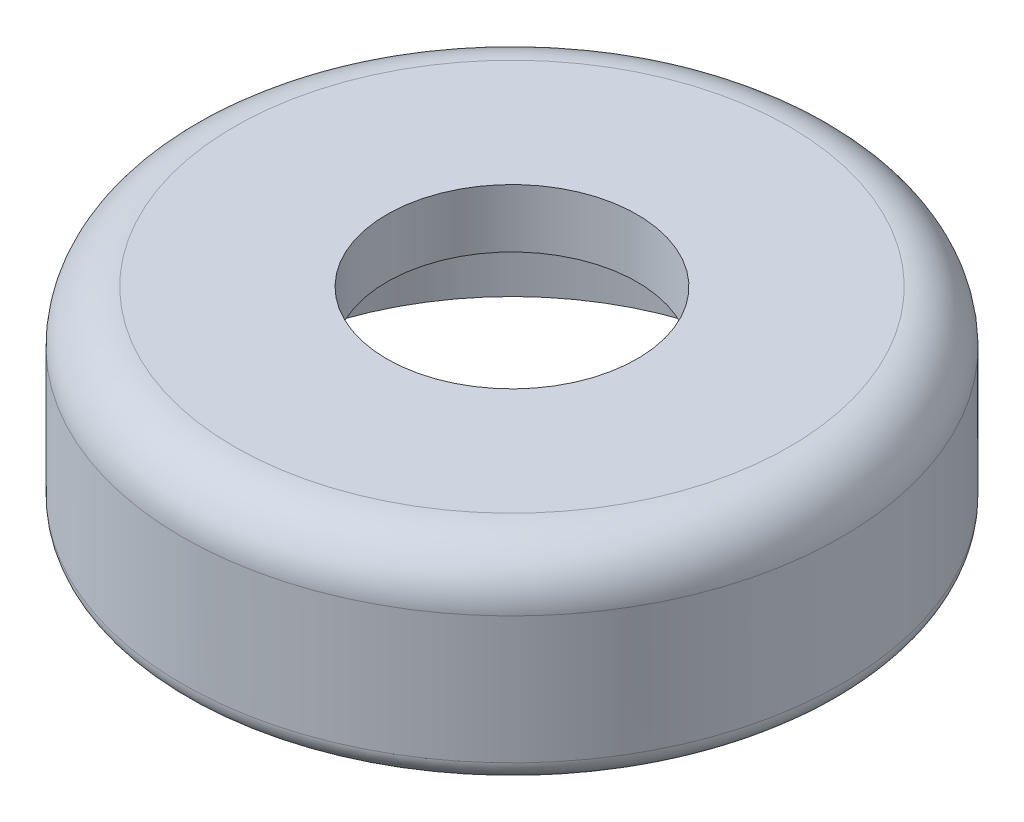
ISO-10303-21;
HEADER;
FILE_DESCRIPTION(('STEP AP214'),'2;1');
FILE_NAME('part.step','',(''),(''),'','','');
FILE_SCHEMA(('AUTOMOTIVE_DESIGN { 1 0 10303 214 1 1 1 1 }'));
ENDSEC;
DATA;
#1=APPLICATION_CONTEXT('core data for automotive mechanical design processes');
#2=APPLICATION_PROTOCOL_DEFINITION('international standard','automotive_design',2000,#1);
#3=PRODUCT_CONTEXT('',#1,'mechanical');
#4=PRODUCT('Part','Part','',(#3));
#5=PRODUCT_RELATED_PRODUCT_CATEGORY('part','',(#4));
#6=PRODUCT_DEFINITION_FORMATION('','',#4);
#7=PRODUCT_DEFINITION_CONTEXT('part definition',#1,'design');
#8=PRODUCT_DEFINITION('design','',#6,#7);
#9=PRODUCT_DEFINITION_SHAPE('','',#8);
#10=(LENGTH_UNIT() NAMED_UNIT(*) SI_UNIT(.MILLI.,.METRE.));
#11=(NAMED_UNIT(*) PLANE_ANGLE_UNIT() SI_UNIT($,.RADIAN.));
#12=(NAMED_UNIT(*) SI_UNIT($,.STERADIAN.) SOLID_ANGLE_UNIT());
#13=UNCERTAINTY_MEASURE_WITH_UNIT(LENGTH_MEASURE(1.E-05),#10,'distance_accuracy_value','');
#14=(GEOMETRIC_REPRESENTATION_CONTEXT(3) GLOBAL_UNCERTAINTY_ASSIGNED_CONTEXT((#13)) GLOBAL_UNIT_ASSIGNED_CONTEXT((#10,
#11,#12)) REPRESENTATION_CONTEXT('',''));
#15=CARTESIAN_POINT('',(0.,0.,0.));
#16=DIRECTION('',(0.,0.,1.));
#17=DIRECTION('',(1.,0.,0.));
#18=AXIS2_PLACEMENT_3D('',#15,#16,#17);
#19=CARTESIAN_POINT('',(0.,0.,0.));
#20=DIRECTION('',(0.,-1.,0.));
#21=DIRECTION('',(0.,0.,-1.));
#22=AXIS2_PLACEMENT_3D('',#19,#20,#21);
#23=CYLINDRICAL_SURFACE('',#22,8.255);
#24=CARTESIAN_POINT('',(0.,0.,0.));
#25=DIRECTION('',(0.,-1.,0.));
#26=DIRECTION('',(0.,0.,-1.));
#27=AXIS2_PLACEMENT_3D('',#24,#25,#26);
#28=CIRCLE('',#27,8.255);
#29=CARTESIAN_POINT('',(0.,0.,-8.255));
#30=VERTEX_POINT('',#29);
#31=EDGE_CURVE('E52',#30,#30,#28,.T.);
#32=ORIENTED_EDGE('',*,*,#31,.T.);
#33=EDGE_LOOP('',(#32));
#34=FACE_BOUND('',#33,.T.);
#35=CARTESIAN_POINT('',(0.,4.318,0.));
#36=DIRECTION('',(0.,-1.,0.));
#37=DIRECTION('',(0.,0.,-1.));
#38=AXIS2_PLACEMENT_3D('',#35,#36,#37);
#39=CIRCLE('',#38,8.255);
#40=CARTESIAN_POINT('',(0.,4.318,-8.255));
#41=VERTEX_POINT('',#40);
#42=EDGE_CURVE('E49',#41,#41,#39,.T.);
#43=ORIENTED_EDGE('',*,*,#42,.F.);
#44=EDGE_LOOP('',(#43));
#45=FACE_BOUND('',#44,.T.);
#46=ADVANCED_FACE('F29',(#34,#45),#23,.F.);
#47=CARTESIAN_POINT('',(0.,4.318,0.));
#48=DIRECTION('',(0.,-1.,0.));
#49=DIRECTION('',(0.,0.,-1.));
#50=AXIS2_PLACEMENT_3D('',#47,#48,#49);
#51=PLANE('',#50);
#52=CARTESIAN_POINT('',(0.,4.318,0.));
#53=DIRECTION('',(0.,-1.,0.));
#54=DIRECTION('',(0.,0.,-1.));
#55=AXIS2_PLACEMENT_3D('',#52,#53,#54);
#56=CIRCLE('',#55,3.81);
#57=CARTESIAN_POINT('',(0.,4.318,3.81));
#58=VERTEX_POINT('',#57);
#59=EDGE_CURVE('E55',#58,#58,#56,.T.);
#60=ORIENTED_EDGE('',*,*,#59,.F.);
#61=EDGE_LOOP('',(#60));
#62=FACE_BOUND('',#61,.T.);
#63=ORIENTED_EDGE('',*,*,#42,.T.);
#64=EDGE_LOOP('',(#63));
#65=FACE_BOUND('',#64,.T.);
#66=ADVANCED_FACE('F68',(#62,#65),#51,.T.);
#67=CARTESIAN_POINT('',(-10.033,6.096,0.));
#68=DIRECTION('',(0.,1.,0.));
#69=DIRECTION('',(0.,0.,1.));
#70=AXIS2_PLACEMENT_3D('',#67,#68,#69);
#71=PLANE('',#70);
#72=CARTESIAN_POINT('',(0.,6.096,0.));
#73=DIRECTION('',(0.,1.,0.));
#74=DIRECTION('',(0.,0.,1.));
#75=AXIS2_PLACEMENT_3D('',#72,#73,#74);
#76=CIRCLE('',#75,3.81);
#77=CARTESIAN_POINT('',(0.,6.096,3.81));
#78=VERTEX_POINT('',#77);
#79=EDGE_CURVE('E58',#78,#78,#76,.T.);
#80=ORIENTED_EDGE('',*,*,#79,.F.);
#81=EDGE_LOOP('',(#80));
#82=FACE_BOUND('',#81,.T.);
#83=CARTESIAN_POINT('',(0.,6.096,0.));
#84=DIRECTION('',(0.,1.,0.));
#85=DIRECTION('',(0.,0.,1.));
#86=AXIS2_PLACEMENT_3D('',#83,#84,#85);
#87=CIRCLE('',#86,8.4455);
#88=CARTESIAN_POINT('',(0.,6.096,8.4455));
#89=VERTEX_POINT('',#88);
#90=EDGE_CURVE('E40',#89,#89,#87,.T.);
#91=ORIENTED_EDGE('',*,*,#90,.T.);
#92=EDGE_LOOP('',(#91));
#93=FACE_BOUND('',#92,.T.);
#94=ADVANCED_FACE('F64',(#82,#93),#71,.T.);
#95=CARTESIAN_POINT('',(0.,0.,0.));
#96=DIRECTION('',(0.,-1.,0.));
#97=DIRECTION('',(0.,0.,-1.));
#98=AXIS2_PLACEMENT_3D('',#95,#96,#97);
#99=CYLINDRICAL_SURFACE('',#98,10.033);
#100=CARTESIAN_POINT('',(0.,0.635,0.));
#101=DIRECTION('',(0.,-1.,0.));
#102=DIRECTION('',(0.,0.,-1.));
#103=AXIS2_PLACEMENT_3D('',#100,#101,#102);
#104=CIRCLE('',#103,10.033);
#105=CARTESIAN_POINT('',(0.,0.635,-10.033));
#106=VERTEX_POINT('',#105);
#107=EDGE_CURVE('E10',#106,#106,#104,.F.);
#108=ORIENTED_EDGE('',*,*,#107,.T.);
#109=EDGE_LOOP('',(#108));
#110=FACE_BOUND('',#109,.T.);
#111=CARTESIAN_POINT('',(0.,4.5085,0.));
#112=DIRECTION('',(0.,1.,0.));
#113=DIRECTION('',(0.,0.,1.));
#114=AXIS2_PLACEMENT_3D('',#111,#112,#113);
#115=CIRCLE('',#114,10.033);
#116=CARTESIAN_POINT('',(0.,4.5085,10.033));
#117=VERTEX_POINT('',#116);
#118=EDGE_CURVE('E44',#117,#117,#115,.F.);
#119=ORIENTED_EDGE('',*,*,#118,.T.);
#120=EDGE_LOOP('',(#119));
#121=FACE_BOUND('',#120,.T.);
#122=ADVANCED_FACE('F67',(#110,#121),#99,.T.);
#123=CARTESIAN_POINT('',(-8.255,0.,0.));
#124=DIRECTION('',(0.,-1.,0.));
#125=DIRECTION('',(0.,0.,-1.));
#126=AXIS2_PLACEMENT_3D('',#123,#124,#125);
#127=PLANE('',#126);
#128=CARTESIAN_POINT('',(0.,0.,0.));
#129=DIRECTION('',(0.,-1.,0.));
#130=DIRECTION('',(0.,0.,-1.));
#131=AXIS2_PLACEMENT_3D('',#128,#129,#130);
#132=CIRCLE('',#131,9.398);
#133=CARTESIAN_POINT('',(0.,0.,-9.398));
#134=VERTEX_POINT('',#133);
#135=EDGE_CURVE('E36',#134,#134,#132,.T.);
#136=ORIENTED_EDGE('',*,*,#135,.T.);
#137=EDGE_LOOP('',(#136));
#138=FACE_BOUND('',#137,.T.);
#139=ORIENTED_EDGE('',*,*,#31,.F.);
#140=EDGE_LOOP('',(#139));
#141=FACE_BOUND('',#140,.T.);
#142=ADVANCED_FACE('F75',(#138,#141),#127,.T.);
#143=CARTESIAN_POINT('',(0.,4.5085,0.));
#144=DIRECTION('',(0.,1.,0.));
#145=DIRECTION('',(0.,0.,1.));
#146=AXIS2_PLACEMENT_3D('',#143,#144,#145);
#147=TOROIDAL_SURFACE('',#146,8.4455,1.5875);
#148=ORIENTED_EDGE('',*,*,#90,.F.);
#149=EDGE_LOOP('',(#148));
#150=FACE_BOUND('',#149,.T.);
#151=ORIENTED_EDGE('',*,*,#118,.F.);
#152=EDGE_LOOP('',(#151));
#153=FACE_BOUND('',#152,.T.);
#154=ADVANCED_FACE('F72',(#150,#153),#147,.T.);
#155=CARTESIAN_POINT('',(0.,0.,0.));
#156=DIRECTION('',(0.,1.,0.));
#157=DIRECTION('',(0.,0.,1.));
#158=AXIS2_PLACEMENT_3D('',#155,#156,#157);
#159=CYLINDRICAL_SURFACE('',#158,3.81);
#160=CARTESIAN_POINT('',(0.,4.318,3.81));
#161=CARTESIAN_POINT('',(0.,4.33652083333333,3.81));
#162=CARTESIAN_POINT('',(0.,4.35504166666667,3.81));
#163=CARTESIAN_POINT('',(0.,4.39208333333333,3.81));
#164=CARTESIAN_POINT('',(0.,4.41060416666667,3.81));
#165=CARTESIAN_POINT('',(0.,4.44764583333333,3.81));
#166=CARTESIAN_POINT('',(0.,4.46616666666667,3.81));
#167=CARTESIAN_POINT('',(0.,4.50320833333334,3.81));
#168=CARTESIAN_POINT('',(0.,4.52172916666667,3.81));
#169=CARTESIAN_POINT('',(0.,4.55877083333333,3.81));
#170=CARTESIAN_POINT('',(0.,4.57729166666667,3.81));
#171=CARTESIAN_POINT('',(0.,4.61433333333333,3.81));
#172=CARTESIAN_POINT('',(0.,4.63285416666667,3.81));
#173=CARTESIAN_POINT('',(0.,4.66989583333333,3.81));
#174=CARTESIAN_POINT('',(0.,4.68841666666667,3.81));
#175=CARTESIAN_POINT('',(0.,4.72545833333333,3.81));
#176=CARTESIAN_POINT('',(0.,4.74397916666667,3.81));
#177=CARTESIAN_POINT('',(0.,4.78102083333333,3.81));
#178=CARTESIAN_POINT('',(0.,4.79954166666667,3.81));
#179=CARTESIAN_POINT('',(0.,4.83658333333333,3.81));
#180=CARTESIAN_POINT('',(0.,4.85510416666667,3.81));
#181=CARTESIAN_POINT('',(0.,4.89214583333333,3.81));
#182=CARTESIAN_POINT('',(0.,4.91066666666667,3.81));
#183=CARTESIAN_POINT('',(0.,4.94770833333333,3.81));
#184=CARTESIAN_POINT('',(0.,4.96622916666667,3.81));
#185=CARTESIAN_POINT('',(0.,5.00327083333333,3.81));
#186=CARTESIAN_POINT('',(0.,5.02179166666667,3.81));
#187=CARTESIAN_POINT('',(0.,5.05883333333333,3.81));
#188=CARTESIAN_POINT('',(0.,5.07735416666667,3.81));
#189=CARTESIAN_POINT('',(0.,5.11439583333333,3.81));
#190=CARTESIAN_POINT('',(0.,5.13291666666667,3.81));
#191=CARTESIAN_POINT('',(0.,5.16995833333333,3.81));
#192=CARTESIAN_POINT('',(0.,5.18847916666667,3.81));
#193=CARTESIAN_POINT('',(0.,5.22552083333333,3.81));
#194=CARTESIAN_POINT('',(0.,5.24404166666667,3.81));
#195=CARTESIAN_POINT('',(0.,5.28108333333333,3.81));
#196=CARTESIAN_POINT('',(0.,5.29960416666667,3.81));
#197=CARTESIAN_POINT('',(0.,5.33664583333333,3.81));
#198=CARTESIAN_POINT('',(0.,5.35516666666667,3.81));
#199=CARTESIAN_POINT('',(0.,5.39220833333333,3.81));
#200=CARTESIAN_POINT('',(0.,5.41072916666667,3.81));
#201=CARTESIAN_POINT('',(0.,5.44777083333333,3.81));
#202=CARTESIAN_POINT('',(0.,5.46629166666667,3.81));
#203=CARTESIAN_POINT('',(0.,5.50333333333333,3.81));
#204=CARTESIAN_POINT('',(0.,5.52185416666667,3.81));
#205=CARTESIAN_POINT('',(0.,5.55889583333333,3.81));
#206=CARTESIAN_POINT('',(0.,5.57741666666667,3.81));
#207=CARTESIAN_POINT('',(0.,5.61445833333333,3.81));
#208=CARTESIAN_POINT('',(0.,5.63297916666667,3.81));
#209=CARTESIAN_POINT('',(0.,5.67002083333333,3.81));
#210=CARTESIAN_POINT('',(0.,5.68854166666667,3.81));
#211=CARTESIAN_POINT('',(0.,5.72558333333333,3.81));
#212=CARTESIAN_POINT('',(0.,5.74410416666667,3.81));
#213=CARTESIAN_POINT('',(0.,5.78114583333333,3.81));
#214=CARTESIAN_POINT('',(0.,5.79966666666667,3.81));
#215=CARTESIAN_POINT('',(0.,5.83670833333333,3.81));
#216=CARTESIAN_POINT('',(0.,5.85522916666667,3.81));
#217=CARTESIAN_POINT('',(0.,5.89227083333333,3.81));
#218=CARTESIAN_POINT('',(0.,5.91079166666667,3.81));
#219=CARTESIAN_POINT('',(0.,5.94783333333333,3.81));
#220=CARTESIAN_POINT('',(0.,5.96635416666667,3.81));
#221=CARTESIAN_POINT('',(0.,6.00339583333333,3.81));
#222=CARTESIAN_POINT('',(0.,6.02191666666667,3.81));
#223=CARTESIAN_POINT('',(0.,6.05895833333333,3.81));
#224=CARTESIAN_POINT('',(0.,6.07747916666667,3.81));
#225=CARTESIAN_POINT('',(0.,6.096,3.81));
#226=B_SPLINE_CURVE_WITH_KNOTS('',3,(#160,#161,#162,#163,#164,#165,#166,#167,#168,#169,#170,
#171,#172,#173,#174,#175,#176,#177,#178,#179,#180,#181,#182,#183,#184,#185,#186,#187,#188,#189,
#190,#191,#192,#193,#194,#195,#196,#197,#198,#199,#200,#201,#202,#203,#204,#205,#206,#207,#208,
#209,#210,#211,#212,#213,#214,#215,#216,#217,#218,#219,#220,#221,#222,#223,#224,#225),
.UNSPECIFIED.,.F.,.F.,(4,2,2,2,2,2,2,2,2,2,2,2,2,2,2,2,2,2,2,2,2,2,2,2,2,2,2,2,2,2,2,2,4),(0.,
0.0555625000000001,0.111125,0.1666875,0.22225,0.277812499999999,0.333374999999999,0.3889375,
0.4445,0.5000625,0.555625,0.6111875,0.666749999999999,0.722312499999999,0.777874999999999,
0.833437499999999,0.888999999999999,0.944562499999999,1.000125,1.0556875,1.11125,1.1668125,
1.222375,1.2779375,1.3335,1.3890625,1.444625,1.5001875,1.55575,1.6113125,1.666875,1.7224375,
1.778),.UNSPECIFIED.);
#227=EDGE_CURVE('BSEAM62',#58,#78,#226,.T.);
#228=ORIENTED_EDGE('',*,*,#59,.T.);
#229=ORIENTED_EDGE('',*,*,#79,.T.);
#230=ORIENTED_EDGE('',*,*,#227,.T.);
#231=ORIENTED_EDGE('',*,*,#227,.F.);
#232=EDGE_LOOP('',(#228,#230,#229,#231));
#233=FACE_BOUND('',#232,.T.);
#234=ADVANCED_FACE('F62',(#233),#159,.F.);
#235=CARTESIAN_POINT('',(0.,0.635,0.));
#236=DIRECTION('',(0.,-1.,0.));
#237=DIRECTION('',(0.,0.,-1.));
#238=AXIS2_PLACEMENT_3D('',#235,#236,#237);
#239=TOROIDAL_SURFACE('',#238,9.398,0.635);
#240=ORIENTED_EDGE('',*,*,#107,.F.);
#241=EDGE_LOOP('',(#240));
#242=FACE_BOUND('',#241,.T.);
#243=ORIENTED_EDGE('',*,*,#135,.F.);
#244=EDGE_LOOP('',(#243));
#245=FACE_BOUND('',#244,.T.);
#246=ADVANCED_FACE('F31',(#242,#245),#239,.T.);
#247=CLOSED_SHELL('',(#46,#66,#94,#122,#142,#154,#234,#246));
#248=MANIFOLD_SOLID_BREP('B2',#247);
#249=ADVANCED_BREP_SHAPE_REPRESENTATION('',(#18,#248),#14);
#250=SHAPE_DEFINITION_REPRESENTATION(#9,#249);
ENDSEC;
END-ISO-10303-21;
